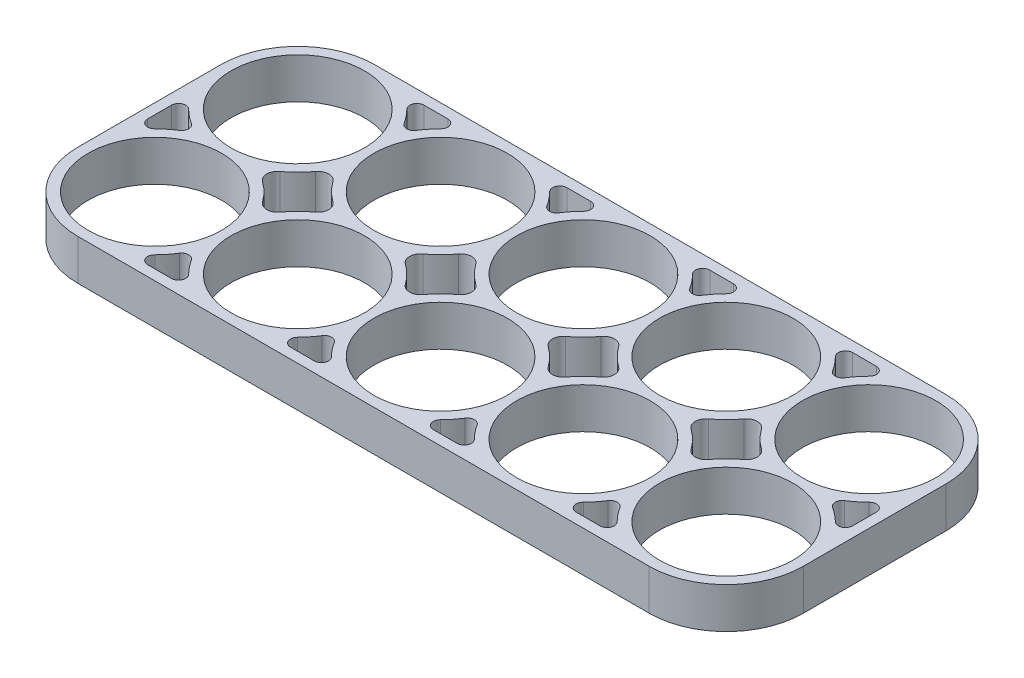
from build123d import *

# Parameters (mm, degrees)
SKIZZE1_R                       = 9.35
AUFSATZ_LINEAR_AUSTRAGEN1_DEPTH = 5.7


with BuildPart() as part:
    # Skizze1 → Aufsatz-Linear austragen1 (new body)
    with BuildSketch(Plane(origin=(0, 0, 0), x_dir=(1, 0, 0), z_dir=(0, 1, 0))):
        with BuildLine():
            Line((-50.8, 10), (-50.8, -10))
            ThreePointArc((-50.8, -10), (-47.636753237, -17.636753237), (-40, -20.8))
            Line((-40, -20.8), (40, -20.8))
            ThreePointArc((40, -20.8), (47.636753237, -17.636753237), (50.8, -10))
            Line((50.8, -10), (50.8, 10))
            ThreePointArc((50.8, 10), (47.636753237, 17.636753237), (40, 20.8))
            Line((40, 20.8), (-40, 20.8))
            ThreePointArc((-40, 20.8), (-47.636753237, 17.636753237), (-50.8, 10))
        make_face()
        with Locations(Location((-40, 10, 0), (0, 0, 270))):
            Circle(SKIZZE1_R, mode=Mode.SUBTRACT)
        with Locations(Location((-20, 10, 0), (0, 0, 270))):
            Circle(SKIZZE1_R, mode=Mode.SUBTRACT)
        with Locations(Location((0, 10, 0), (0, 0, 270))):
            Circle(SKIZZE1_R, mode=Mode.SUBTRACT)
        with Locations(Location((20, 10, 0), (0, 0, 270))):
            Circle(SKIZZE1_R, mode=Mode.SUBTRACT)
        with Locations(Location((40, 10, 0), (0, 0, 270))):
            Circle(SKIZZE1_R, mode=Mode.SUBTRACT)
        with Locations(Location((40, -10, 0), (0, 0, 270))):
            Circle(SKIZZE1_R, mode=Mode.SUBTRACT)
        with Locations(Location((20, -10, 0), (0, 0, 270))):
            Circle(SKIZZE1_R, mode=Mode.SUBTRACT)
        with Locations(Location((0, -10, 0), (0, 0, 270))):
            Circle(SKIZZE1_R, mode=Mode.SUBTRACT)
        with Locations(Location((-20, -10, 0), (0, 0, 270))):
            Circle(SKIZZE1_R, mode=Mode.SUBTRACT)
        with Locations(Location((-40, -10, 0), (0, 0, 270))):
            Circle(SKIZZE1_R, mode=Mode.SUBTRACT)
        with BuildLine():
            Line((-49.35, 1.662284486), (-49.35, -1.662284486))
            ThreePointArc((-49.35, -1.662284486), (-48.732343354, -2.58630481), (-47.642372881, -2.368870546))
            ThreePointArc((-47.642372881, -2.368870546), (-46.730970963, -1.554052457), (-45.733320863, -0.847457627))
            ThreePointArc((-45.733320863, -0.847457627), (-45.264183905, 0), (-45.733320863, 0.847457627))
            ThreePointArc((-45.733320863, 0.847457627), (-46.730970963, 1.554052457), (-47.642372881, 2.368870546))
            ThreePointArc((-47.642372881, 2.368870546), (-48.732343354, 2.58630481), (-49.35, 1.662284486))
        make_face(mode=Mode.SUBTRACT)
        with BuildLine():
            Line((-31.662284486, 19.35), (-28.337715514, 19.35))
            ThreePointArc((-28.337715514, 19.35), (-27.41369519, 18.732343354), (-27.631129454, 17.642372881))
            ThreePointArc((-27.631129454, 17.642372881), (-28.445947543, 16.730970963), (-29.152542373, 15.733320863))
            ThreePointArc((-29.152542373, 15.733320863), (-30, 15.264183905), (-30.847457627, 15.733320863))
            ThreePointArc((-30.847457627, 15.733320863), (-31.554052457, 16.730970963), (-32.368870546, 17.642372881))
            ThreePointArc((-32.368870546, 17.642372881), (-32.58630481, 18.732343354), (-31.662284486, 19.35))
        make_face(mode=Mode.SUBTRACT)
        with BuildLine():
            Line((-31.662284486, -19.35), (-28.337715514, -19.35))
            ThreePointArc((-28.337715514, -19.35), (-27.41369519, -18.732343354), (-27.631129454, -17.642372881))
            ThreePointArc((-27.631129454, -17.642372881), (-28.445947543, -16.730970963), (-29.152542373, -15.733320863))
            ThreePointArc((-29.152542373, -15.733320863), (-30, -15.264183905), (-30.847457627, -15.733320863))
            ThreePointArc((-30.847457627, -15.733320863), (-31.554052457, -16.730970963), (-32.368870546, -17.642372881))
            ThreePointArc((-32.368870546, -17.642372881), (-32.58630481, -18.732343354), (-31.662284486, -19.35))
        make_face(mode=Mode.SUBTRACT)
        with BuildLine():
            Line((49.35, 1.662284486), (49.35, -1.662284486))
            ThreePointArc((49.35, -1.662284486), (48.732343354, -2.58630481), (47.642372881, -2.368870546))
            ThreePointArc((47.642372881, -2.368870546), (46.730970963, -1.554052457), (45.733320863, -0.847457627))
            ThreePointArc((45.733320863, -0.847457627), (45.264183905, 0), (45.733320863, 0.847457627))
            ThreePointArc((45.733320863, 0.847457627), (46.730970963, 1.554052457), (47.642372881, 2.368870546))
            ThreePointArc((47.642372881, 2.368870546), (48.732343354, 2.58630481), (49.35, 1.662284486))
        make_face(mode=Mode.SUBTRACT)
        with BuildLine():
            Line((-11.662284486, -19.35), (-8.337715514, -19.35))
            ThreePointArc((-8.337715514, -19.35), (-7.41369519, -18.732343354), (-7.631129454, -17.642372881))
            ThreePointArc((-7.631129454, -17.642372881), (-8.445947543, -16.730970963), (-9.152542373, -15.733320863))
            ThreePointArc((-9.152542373, -15.733320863), (-10, -15.264183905), (-10.847457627, -15.733320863))
            ThreePointArc((-10.847457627, -15.733320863), (-11.554052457, -16.730970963), (-12.368870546, -17.642372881))
            ThreePointArc((-12.368870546, -17.642372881), (-12.58630481, -18.732343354), (-11.662284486, -19.35))
        make_face(mode=Mode.SUBTRACT)
        with BuildLine():
            Line((8.337715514, -19.35), (11.662284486, -19.35))
            ThreePointArc((11.662284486, -19.35), (12.58630481, -18.732343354), (12.368870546, -17.642372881))
            ThreePointArc((12.368870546, -17.642372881), (11.554052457, -16.730970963), (10.847457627, -15.733320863))
            ThreePointArc((10.847457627, -15.733320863), (10, -15.264183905), (9.152542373, -15.733320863))
            ThreePointArc((9.152542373, -15.733320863), (8.445947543, -16.730970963), (7.631129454, -17.642372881))
            ThreePointArc((7.631129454, -17.642372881), (7.41369519, -18.732343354), (8.337715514, -19.35))
        make_face(mode=Mode.SUBTRACT)
        with BuildLine():
            Line((28.337715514, -19.35), (31.662284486, -19.35))
            ThreePointArc((31.662284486, -19.35), (32.58630481, -18.732343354), (32.368870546, -17.642372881))
            ThreePointArc((32.368870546, -17.642372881), (31.554052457, -16.730970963), (30.847457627, -15.733320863))
            ThreePointArc((30.847457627, -15.733320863), (30, -15.264183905), (29.152542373, -15.733320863))
            ThreePointArc((29.152542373, -15.733320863), (28.445947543, -16.730970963), (27.631129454, -17.642372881))
            ThreePointArc((27.631129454, -17.642372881), (27.41369519, -18.732343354), (28.337715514, -19.35))
        make_face(mode=Mode.SUBTRACT)
        with BuildLine():
            Line((-11.662284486, 19.35), (-8.337715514, 19.35))
            ThreePointArc((-8.337715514, 19.35), (-7.41369519, 18.732343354), (-7.631129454, 17.642372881))
            ThreePointArc((-7.631129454, 17.642372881), (-8.445947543, 16.730970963), (-9.152542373, 15.733320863))
            ThreePointArc((-9.152542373, 15.733320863), (-10, 15.264183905), (-10.847457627, 15.733320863))
            ThreePointArc((-10.847457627, 15.733320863), (-11.554052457, 16.730970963), (-12.368870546, 17.642372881))
            ThreePointArc((-12.368870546, 17.642372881), (-12.58630481, 18.732343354), (-11.662284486, 19.35))
        make_face(mode=Mode.SUBTRACT)
        with BuildLine():
            Line((8.337715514, 19.35), (11.662284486, 19.35))
            ThreePointArc((11.662284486, 19.35), (12.58630481, 18.732343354), (12.368870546, 17.642372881))
            ThreePointArc((12.368870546, 17.642372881), (11.554052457, 16.730970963), (10.847457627, 15.733320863))
            ThreePointArc((10.847457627, 15.733320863), (10, 15.264183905), (9.152542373, 15.733320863))
            ThreePointArc((9.152542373, 15.733320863), (8.445947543, 16.730970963), (7.631129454, 17.642372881))
            ThreePointArc((7.631129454, 17.642372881), (7.41369519, 18.732343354), (8.337715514, 19.35))
        make_face(mode=Mode.SUBTRACT)
        with BuildLine():
            Line((28.337715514, 19.35), (31.662284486, 19.35))
            ThreePointArc((31.662284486, 19.35), (32.58630481, 18.732343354), (32.368870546, 17.642372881))
            ThreePointArc((32.368870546, 17.642372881), (31.554052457, 16.730970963), (30.847457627, 15.733320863))
            ThreePointArc((30.847457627, 15.733320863), (30, 15.264183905), (29.152542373, 15.733320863))
            ThreePointArc((29.152542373, 15.733320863), (28.445947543, 16.730970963), (27.631129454, 17.642372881))
            ThreePointArc((27.631129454, 17.642372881), (27.41369519, 18.732343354), (28.337715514, 19.35))
        make_face(mode=Mode.SUBTRACT)
        with BuildLine():
            ThreePointArc((-33.711674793, 1.219512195), (-32.363246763, 2.363246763), (-31.219512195, 3.711674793))
            ThreePointArc((-31.219512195, 3.711674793), (-30, 4.338296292), (-28.780487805, 3.711674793))
            ThreePointArc((-28.780487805, 3.711674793), (-27.636753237, 2.363246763), (-26.288325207, 1.219512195))
            ThreePointArc((-26.288325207, 1.219512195), (-25.661703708, 0), (-26.288325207, -1.219512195))
            ThreePointArc((-26.288325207, -1.219512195), (-27.636753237, -2.363246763), (-28.780487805, -3.711674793))
            ThreePointArc((-28.780487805, -3.711674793), (-30, -4.338296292), (-31.219512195, -3.711674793))
            ThreePointArc((-31.219512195, -3.711674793), (-32.363246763, -2.363246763), (-33.711674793, -1.219512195))
            ThreePointArc((-33.711674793, -1.219512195), (-34.338296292, 0), (-33.711674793, 1.219512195))
        make_face(mode=Mode.SUBTRACT)
        with BuildLine():
            ThreePointArc((-13.711674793, 1.219512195), (-12.363246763, 2.363246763), (-11.219512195, 3.711674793))
            ThreePointArc((-11.219512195, 3.711674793), (-10, 4.338296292), (-8.780487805, 3.711674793))
            ThreePointArc((-8.780487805, 3.711674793), (-7.636753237, 2.363246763), (-6.288325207, 1.219512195))
            ThreePointArc((-6.288325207, 1.219512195), (-5.661703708, 0), (-6.288325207, -1.219512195))
            ThreePointArc((-6.288325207, -1.219512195), (-7.636753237, -2.363246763), (-8.780487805, -3.711674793))
            ThreePointArc((-8.780487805, -3.711674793), (-10, -4.338296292), (-11.219512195, -3.711674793))
            ThreePointArc((-11.219512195, -3.711674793), (-12.363246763, -2.363246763), (-13.711674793, -1.219512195))
            ThreePointArc((-13.711674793, -1.219512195), (-14.338296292, 0), (-13.711674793, 1.219512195))
        make_face(mode=Mode.SUBTRACT)
        with BuildLine():
            ThreePointArc((6.288325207, 1.219512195), (7.636753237, 2.363246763), (8.780487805, 3.711674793))
            ThreePointArc((8.780487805, 3.711674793), (10, 4.338296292), (11.219512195, 3.711674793))
            ThreePointArc((11.219512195, 3.711674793), (12.363246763, 2.363246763), (13.711674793, 1.219512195))
            ThreePointArc((13.711674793, 1.219512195), (14.338296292, 0), (13.711674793, -1.219512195))
            ThreePointArc((13.711674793, -1.219512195), (12.363246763, -2.363246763), (11.219512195, -3.711674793))
            ThreePointArc((11.219512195, -3.711674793), (10, -4.338296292), (8.780487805, -3.711674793))
            ThreePointArc((8.780487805, -3.711674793), (7.636753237, -2.363246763), (6.288325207, -1.219512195))
            ThreePointArc((6.288325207, -1.219512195), (5.661703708, 0), (6.288325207, 1.219512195))
        make_face(mode=Mode.SUBTRACT)
        with BuildLine():
            ThreePointArc((26.288325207, 1.219512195), (27.636753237, 2.363246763), (28.780487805, 3.711674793))
            ThreePointArc((28.780487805, 3.711674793), (30, 4.338296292), (31.219512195, 3.711674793))
            ThreePointArc((31.219512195, 3.711674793), (32.363246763, 2.363246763), (33.711674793, 1.219512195))
            ThreePointArc((33.711674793, 1.219512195), (34.338296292, 0), (33.711674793, -1.219512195))
            ThreePointArc((33.711674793, -1.219512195), (32.363246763, -2.363246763), (31.219512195, -3.711674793))
            ThreePointArc((31.219512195, -3.711674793), (30, -4.338296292), (28.780487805, -3.711674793))
            ThreePointArc((28.780487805, -3.711674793), (27.636753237, -2.363246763), (26.288325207, -1.219512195))
            ThreePointArc((26.288325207, -1.219512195), (25.661703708, 0), (26.288325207, 1.219512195))
        make_face(mode=Mode.SUBTRACT)
    extrude(amount=AUFSATZ_LINEAR_AUSTRAGEN1_DEPTH)


solid = part.part
